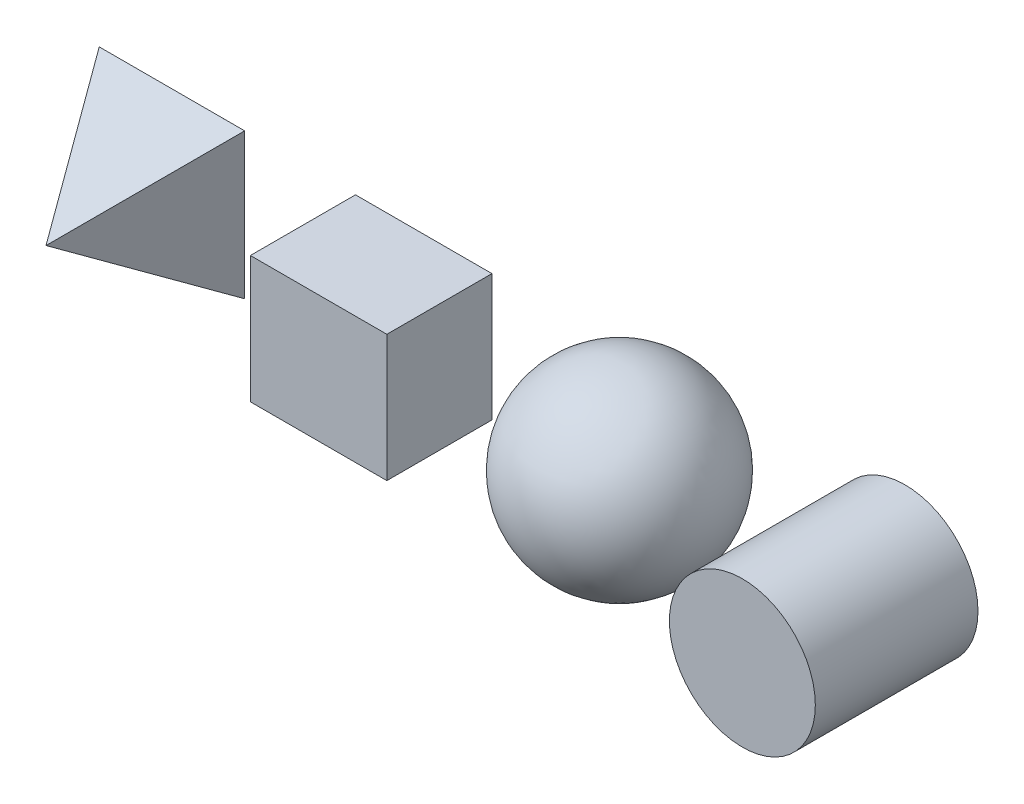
ISO-10303-21;
HEADER;
FILE_DESCRIPTION(('STEP AP214'),'2;1');
FILE_NAME('part.step','',(''),(''),'','','');
FILE_SCHEMA(('AUTOMOTIVE_DESIGN { 1 0 10303 214 1 1 1 1 }'));
ENDSEC;
DATA;
#1=APPLICATION_CONTEXT('core data for automotive mechanical design processes');
#2=APPLICATION_PROTOCOL_DEFINITION('international standard','automotive_design',2000,#1);
#3=PRODUCT_CONTEXT('',#1,'mechanical');
#4=PRODUCT('Part','Part','',(#3));
#5=PRODUCT_RELATED_PRODUCT_CATEGORY('part','',(#4));
#6=PRODUCT_DEFINITION_FORMATION('','',#4);
#7=PRODUCT_DEFINITION_CONTEXT('part definition',#1,'design');
#8=PRODUCT_DEFINITION('design','',#6,#7);
#9=PRODUCT_DEFINITION_SHAPE('','',#8);
#10=(LENGTH_UNIT() NAMED_UNIT(*) SI_UNIT(.MILLI.,.METRE.));
#11=(NAMED_UNIT(*) PLANE_ANGLE_UNIT() SI_UNIT($,.RADIAN.));
#12=(NAMED_UNIT(*) SI_UNIT($,.STERADIAN.) SOLID_ANGLE_UNIT());
#13=UNCERTAINTY_MEASURE_WITH_UNIT(LENGTH_MEASURE(1.E-05),#10,'distance_accuracy_value','');
#14=(GEOMETRIC_REPRESENTATION_CONTEXT(3) GLOBAL_UNCERTAINTY_ASSIGNED_CONTEXT((#13)) GLOBAL_UNIT_ASSIGNED_CONTEXT((#10,
#11,#12)) REPRESENTATION_CONTEXT('',''));
#15=CARTESIAN_POINT('',(0.,0.,0.));
#16=DIRECTION('',(0.,0.,1.));
#17=DIRECTION('',(1.,0.,0.));
#18=AXIS2_PLACEMENT_3D('',#15,#16,#17);
#19=CARTESIAN_POINT('',(56.326124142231,-9.08128608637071,9.75748641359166));
#20=DIRECTION('',(0.,1.,0.));
#21=DIRECTION('',(1.,0.,0.));
#22=AXIS2_PLACEMENT_3D('',#19,#20,#21);
#23=SPHERICAL_SURFACE('',#22,16.6165677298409);
#24=CARTESIAN_POINT('',(56.326124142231,7.53528164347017,9.75748641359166));
#25=VERTEX_POINT('',#24);
#26=VERTEX_LOOP('',#25);
#27=FACE_BOUND('',#26,.T.);
#28=ADVANCED_FACE('F39',(#27),#23,.T.);
#29=CLOSED_SHELL('',(#28));
#30=MANIFOLD_SOLID_BREP('B2',#29);
#31=CARTESIAN_POINT('',(96.9569140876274,-8.69775533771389,28.702));
#32=DIRECTION('',(0.,0.,-1.));
#33=DIRECTION('',(-1.,0.,0.));
#34=AXIS2_PLACEMENT_3D('',#31,#32,#33);
#35=CYLINDRICAL_SURFACE('',#34,12.874709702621);
#36=CARTESIAN_POINT('',(96.9569140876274,-8.69775533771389,28.702));
#37=DIRECTION('',(0.,0.,1.));
#38=DIRECTION('',(1.,0.,0.));
#39=AXIS2_PLACEMENT_3D('',#36,#37,#38);
#40=CIRCLE('',#39,12.874709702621);
#41=CARTESIAN_POINT('',(109.831623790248,-8.69775533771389,28.702));
#42=VERTEX_POINT('',#41);
#43=EDGE_CURVE('E38',#42,#42,#40,.T.);
#44=ORIENTED_EDGE('',*,*,#43,.F.);
#45=EDGE_LOOP('',(#44));
#46=FACE_BOUND('',#45,.T.);
#47=CARTESIAN_POINT('',(96.9569140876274,-8.69775533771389,0.));
#48=DIRECTION('',(0.,0.,1.));
#49=DIRECTION('',(1.,0.,0.));
#50=AXIS2_PLACEMENT_3D('',#47,#48,#49);
#51=CIRCLE('',#50,12.874709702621);
#52=CARTESIAN_POINT('',(109.831623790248,-8.69775533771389,0.));
#53=VERTEX_POINT('',#52);
#54=EDGE_CURVE('E64',#53,#53,#51,.T.);
#55=ORIENTED_EDGE('',*,*,#54,.T.);
#56=EDGE_LOOP('',(#55));
#57=FACE_BOUND('',#56,.T.);
#58=ADVANCED_FACE('F61',(#46,#57),#35,.T.);
#59=CARTESIAN_POINT('',(96.9569140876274,-8.69775533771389,28.702));
#60=DIRECTION('',(0.,0.,1.));
#61=DIRECTION('',(1.,0.,0.));
#62=AXIS2_PLACEMENT_3D('',#59,#60,#61);
#63=PLANE('',#62);
#64=ORIENTED_EDGE('',*,*,#43,.T.);
#65=EDGE_LOOP('',(#64));
#66=FACE_BOUND('',#65,.T.);
#67=ADVANCED_FACE('F76',(#66),#63,.T.);
#68=CARTESIAN_POINT('',(96.9569140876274,-8.69775533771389,0.));
#69=DIRECTION('',(0.,0.,1.));
#70=DIRECTION('',(1.,0.,0.));
#71=AXIS2_PLACEMENT_3D('',#68,#69,#70);
#72=PLANE('',#71);
#73=ORIENTED_EDGE('',*,*,#54,.F.);
#74=EDGE_LOOP('',(#73));
#75=FACE_BOUND('',#74,.T.);
#76=ADVANCED_FACE('F74',(#75),#72,.F.);
#77=CLOSED_SHELL('',(#58,#67,#76));
#78=MANIFOLD_SOLID_BREP('B6',#77);
#79=CARTESIAN_POINT('',(-19.5516794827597,0.,0.));
#80=DIRECTION('',(0.866025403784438,0.,0.500000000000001));
#81=DIRECTION('',(0.500000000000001,0.,-0.866025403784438));
#82=AXIS2_PLACEMENT_3D('',#79,#80,#81);
#83=PLANE('',#82);
#84=DIRECTION('',(0.,1.,0.));
#85=VECTOR('',#84,1.);
#86=CARTESIAN_POINT('',(-19.5516794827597,0.,0.));
#87=LINE('',#86,#85);
#88=CARTESIAN_POINT('',(-19.5516794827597,-25.6603593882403,0.));
#89=VERTEX_POINT('',#88);
#90=CARTESIAN_POINT('',(-19.5516794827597,0.,0.));
#91=VERTEX_POINT('',#90);
#92=EDGE_CURVE('E147',#89,#91,#87,.T.);
#93=ORIENTED_EDGE('',*,*,#92,.T.);
#94=DIRECTION('',(0.447213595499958,0.447213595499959,-0.774596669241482));
#95=VECTOR('',#94,1.);
#96=CARTESIAN_POINT('',(-19.5516794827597,0.,0.));
#97=LINE('',#96,#95);
#98=CARTESIAN_POINT('',(-32.3818591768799,-12.8301796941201,22.2225231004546));
#99=VERTEX_POINT('',#98);
#100=EDGE_CURVE('E59',#99,#91,#97,.T.);
#101=ORIENTED_EDGE('',*,*,#100,.F.);
#102=DIRECTION('',(0.447213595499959,-0.447213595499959,-0.774596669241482));
#103=VECTOR('',#102,1.);
#104=CARTESIAN_POINT('',(-24.6837513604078,-20.5282875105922,8.88900924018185));
#105=LINE('',#104,#103);
#106=EDGE_CURVE('E132',#99,#89,#105,.T.);
#107=ORIENTED_EDGE('',*,*,#106,.T.);
#108=EDGE_LOOP('',(#93,#101,#107));
#109=FACE_BOUND('',#108,.T.);
#110=ADVANCED_FACE('F110',(#109),#83,.T.);
#111=CARTESIAN_POINT('',(-19.5516794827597,0.,0.));
#112=DIRECTION('',(0.,0.866025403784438,0.500000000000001));
#113=DIRECTION('',(0.,-0.500000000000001,0.866025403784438));
#114=AXIS2_PLACEMENT_3D('',#111,#112,#113);
#115=PLANE('',#114);
#116=DIRECTION('',(-1.,0.,0.));
#117=VECTOR('',#116,1.);
#118=CARTESIAN_POINT('',(-19.5516794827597,0.,0.));
#119=LINE('',#118,#117);
#120=CARTESIAN_POINT('',(-45.212038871,0.,0.));
#121=VERTEX_POINT('',#120);
#122=EDGE_CURVE('E144',#91,#121,#119,.T.);
#123=ORIENTED_EDGE('',*,*,#122,.T.);
#124=DIRECTION('',(-0.447213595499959,0.447213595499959,-0.774596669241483));
#125=VECTOR('',#124,1.);
#126=CARTESIAN_POINT('',(-45.212038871,0.,0.));
#127=LINE('',#126,#125);
#128=EDGE_CURVE('E114',#99,#121,#127,.T.);
#129=ORIENTED_EDGE('',*,*,#128,.F.);
#130=ORIENTED_EDGE('',*,*,#100,.T.);
#131=EDGE_LOOP('',(#123,#129,#130));
#132=FACE_BOUND('',#131,.T.);
#133=ADVANCED_FACE('F112',(#132),#115,.T.);
#134=CARTESIAN_POINT('',(-45.212038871,0.,0.));
#135=DIRECTION('',(-0.866025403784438,0.,0.500000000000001));
#136=DIRECTION('',(0.500000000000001,0.,0.866025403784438));
#137=AXIS2_PLACEMENT_3D('',#134,#135,#136);
#138=PLANE('',#137);
#139=DIRECTION('',(0.,-1.,0.));
#140=VECTOR('',#139,1.);
#141=CARTESIAN_POINT('',(-45.212038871,0.,0.));
#142=LINE('',#141,#140);
#143=CARTESIAN_POINT('',(-45.212038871,-25.6603593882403,0.));
#144=VERTEX_POINT('',#143);
#145=EDGE_CURVE('E149',#121,#144,#142,.T.);
#146=ORIENTED_EDGE('',*,*,#145,.T.);
#147=DIRECTION('',(-0.447213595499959,-0.447213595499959,-0.774596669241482));
#148=VECTOR('',#147,1.);
#149=CARTESIAN_POINT('',(-40.0799669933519,-20.5282875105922,8.88900924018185));
#150=LINE('',#149,#148);
#151=EDGE_CURVE('E156',#99,#144,#150,.T.);
#152=ORIENTED_EDGE('',*,*,#151,.F.);
#153=ORIENTED_EDGE('',*,*,#128,.T.);
#154=EDGE_LOOP('',(#146,#152,#153));
#155=FACE_BOUND('',#154,.T.);
#156=ADVANCED_FACE('F159',(#155),#138,.T.);
#157=CARTESIAN_POINT('',(-19.5516794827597,-25.6603593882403,0.));
#158=DIRECTION('',(0.,-0.866025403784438,0.500000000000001));
#159=DIRECTION('',(0.,-0.500000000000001,-0.866025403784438));
#160=AXIS2_PLACEMENT_3D('',#157,#158,#159);
#161=PLANE('',#160);
#162=DIRECTION('',(1.,0.,0.));
#163=VECTOR('',#162,1.);
#164=CARTESIAN_POINT('',(-19.5516794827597,-25.6603593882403,0.));
#165=LINE('',#164,#163);
#166=EDGE_CURVE('E154',#144,#89,#165,.T.);
#167=ORIENTED_EDGE('',*,*,#166,.T.);
#168=ORIENTED_EDGE('',*,*,#106,.F.);
#169=ORIENTED_EDGE('',*,*,#151,.T.);
#170=EDGE_LOOP('',(#167,#168,#169));
#171=FACE_BOUND('',#170,.T.);
#172=ADVANCED_FACE('F160',(#171),#161,.T.);
#173=CARTESIAN_POINT('',(-19.5516794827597,0.,0.));
#174=DIRECTION('',(0.,0.,-1.));
#175=DIRECTION('',(-1.,0.,0.));
#176=AXIS2_PLACEMENT_3D('',#173,#174,#175);
#177=PLANE('',#176);
#178=ORIENTED_EDGE('',*,*,#92,.F.);
#179=ORIENTED_EDGE('',*,*,#166,.F.);
#180=ORIENTED_EDGE('',*,*,#145,.F.);
#181=ORIENTED_EDGE('',*,*,#122,.F.);
#182=EDGE_LOOP('',(#178,#179,#180,#181));
#183=FACE_BOUND('',#182,.T.);
#184=ADVANCED_FACE('F145',(#183),#177,.T.);
#185=CLOSED_SHELL('',(#110,#133,#156,#172,#184));
#186=MANIFOLD_SOLID_BREP('B33',#185);
#187=CARTESIAN_POINT('',(0.,0.,18.542));
#188=DIRECTION('',(1.,0.,0.));
#189=DIRECTION('',(0.,0.,-1.));
#190=AXIS2_PLACEMENT_3D('',#187,#188,#189);
#191=PLANE('',#190);
#192=DIRECTION('',(0.,-1.,0.));
#193=VECTOR('',#192,1.);
#194=CARTESIAN_POINT('',(0.,0.,0.));
#195=LINE('',#194,#193);
#196=CARTESIAN_POINT('',(0.,0.,0.));
#197=VERTEX_POINT('',#196);
#198=CARTESIAN_POINT('',(0.,-22.3640159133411,0.));
#199=VERTEX_POINT('',#198);
#200=EDGE_CURVE('E264',#197,#199,#195,.T.);
#201=ORIENTED_EDGE('',*,*,#200,.T.);
#202=DIRECTION('',(0.,0.,-1.));
#203=VECTOR('',#202,1.);
#204=CARTESIAN_POINT('',(0.,-22.3640159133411,18.542));
#205=LINE('',#204,#203);
#206=CARTESIAN_POINT('',(0.,-22.3640159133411,18.542));
#207=VERTEX_POINT('',#206);
#208=EDGE_CURVE('E108',#207,#199,#205,.T.);
#209=ORIENTED_EDGE('',*,*,#208,.F.);
#210=DIRECTION('',(0.,-1.,0.));
#211=VECTOR('',#210,1.);
#212=CARTESIAN_POINT('',(0.,0.,18.542));
#213=LINE('',#212,#211);
#214=CARTESIAN_POINT('',(0.,0.,18.542));
#215=VERTEX_POINT('',#214);
#216=EDGE_CURVE('E252',#215,#207,#213,.T.);
#217=ORIENTED_EDGE('',*,*,#216,.F.);
#218=DIRECTION('',(0.,0.,-1.));
#219=VECTOR('',#218,1.);
#220=CARTESIAN_POINT('',(0.,0.,18.542));
#221=LINE('',#220,#219);
#222=EDGE_CURVE('E260',#215,#197,#221,.T.);
#223=ORIENTED_EDGE('',*,*,#222,.T.);
#224=EDGE_LOOP('',(#201,#209,#217,#223));
#225=FACE_BOUND('',#224,.T.);
#226=ADVANCED_FACE('F201',(#225),#191,.F.);
#227=CARTESIAN_POINT('',(0.,-22.3640159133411,18.542));
#228=DIRECTION('',(0.,1.,0.));
#229=DIRECTION('',(0.,0.,1.));
#230=AXIS2_PLACEMENT_3D('',#227,#228,#229);
#231=PLANE('',#230);
#232=DIRECTION('',(1.,0.,0.));
#233=VECTOR('',#232,1.);
#234=CARTESIAN_POINT('',(0.,-22.3640159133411,0.));
#235=LINE('',#234,#233);
#236=CARTESIAN_POINT('',(24.0770824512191,-22.3640159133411,0.));
#237=VERTEX_POINT('',#236);
#238=EDGE_CURVE('E256',#199,#237,#235,.T.);
#239=ORIENTED_EDGE('',*,*,#238,.T.);
#240=DIRECTION('',(0.,0.,-1.));
#241=VECTOR('',#240,1.);
#242=CARTESIAN_POINT('',(24.0770824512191,-22.3640159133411,18.542));
#243=LINE('',#242,#241);
#244=CARTESIAN_POINT('',(24.0770824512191,-22.3640159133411,18.542));
#245=VERTEX_POINT('',#244);
#246=EDGE_CURVE('E209',#245,#237,#243,.T.);
#247=ORIENTED_EDGE('',*,*,#246,.F.);
#248=DIRECTION('',(1.,0.,0.));
#249=VECTOR('',#248,1.);
#250=CARTESIAN_POINT('',(0.,-22.3640159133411,18.542));
#251=LINE('',#250,#249);
#252=EDGE_CURVE('E247',#207,#245,#251,.T.);
#253=ORIENTED_EDGE('',*,*,#252,.F.);
#254=ORIENTED_EDGE('',*,*,#208,.T.);
#255=EDGE_LOOP('',(#239,#247,#253,#254));
#256=FACE_BOUND('',#255,.T.);
#257=ADVANCED_FACE('F255',(#256),#231,.F.);
#258=CARTESIAN_POINT('',(24.0770824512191,0.,18.542));
#259=DIRECTION('',(-1.,0.,0.));
#260=DIRECTION('',(0.,0.,1.));
#261=AXIS2_PLACEMENT_3D('',#258,#259,#260);
#262=PLANE('',#261);
#263=DIRECTION('',(0.,1.,0.));
#264=VECTOR('',#263,1.);
#265=CARTESIAN_POINT('',(24.0770824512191,0.,0.));
#266=LINE('',#265,#264);
#267=CARTESIAN_POINT('',(24.0770824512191,0.,0.));
#268=VERTEX_POINT('',#267);
#269=EDGE_CURVE('E234',#237,#268,#266,.T.);
#270=ORIENTED_EDGE('',*,*,#269,.T.);
#271=DIRECTION('',(0.,0.,-1.));
#272=VECTOR('',#271,1.);
#273=CARTESIAN_POINT('',(24.0770824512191,0.,18.542));
#274=LINE('',#273,#272);
#275=CARTESIAN_POINT('',(24.0770824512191,0.,18.542));
#276=VERTEX_POINT('',#275);
#277=EDGE_CURVE('E257',#276,#268,#274,.T.);
#278=ORIENTED_EDGE('',*,*,#277,.F.);
#279=DIRECTION('',(0.,1.,0.));
#280=VECTOR('',#279,1.);
#281=CARTESIAN_POINT('',(24.0770824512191,0.,18.542));
#282=LINE('',#281,#280);
#283=EDGE_CURVE('E250',#245,#276,#282,.T.);
#284=ORIENTED_EDGE('',*,*,#283,.F.);
#285=ORIENTED_EDGE('',*,*,#246,.T.);
#286=EDGE_LOOP('',(#270,#278,#284,#285));
#287=FACE_BOUND('',#286,.T.);
#288=ADVANCED_FACE('F258',(#287),#262,.F.);
#289=CARTESIAN_POINT('',(0.,0.,18.542));
#290=DIRECTION('',(0.,-1.,0.));
#291=DIRECTION('',(0.,0.,-1.));
#292=AXIS2_PLACEMENT_3D('',#289,#290,#291);
#293=PLANE('',#292);
#294=DIRECTION('',(-1.,0.,0.));
#295=VECTOR('',#294,1.);
#296=CARTESIAN_POINT('',(0.,0.,0.));
#297=LINE('',#296,#295);
#298=EDGE_CURVE('E240',#268,#197,#297,.T.);
#299=ORIENTED_EDGE('',*,*,#298,.T.);
#300=ORIENTED_EDGE('',*,*,#222,.F.);
#301=DIRECTION('',(-1.,0.,0.));
#302=VECTOR('',#301,1.);
#303=CARTESIAN_POINT('',(0.,0.,18.542));
#304=LINE('',#303,#302);
#305=EDGE_CURVE('E217',#276,#215,#304,.T.);
#306=ORIENTED_EDGE('',*,*,#305,.F.);
#307=ORIENTED_EDGE('',*,*,#277,.T.);
#308=EDGE_LOOP('',(#299,#300,#306,#307));
#309=FACE_BOUND('',#308,.T.);
#310=ADVANCED_FACE('F271',(#309),#293,.F.);
#311=CARTESIAN_POINT('',(0.,-22.3640159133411,18.542));
#312=DIRECTION('',(0.,0.,1.));
#313=DIRECTION('',(1.,0.,0.));
#314=AXIS2_PLACEMENT_3D('',#311,#312,#313);
#315=PLANE('',#314);
#316=ORIENTED_EDGE('',*,*,#216,.T.);
#317=ORIENTED_EDGE('',*,*,#252,.T.);
#318=ORIENTED_EDGE('',*,*,#283,.T.);
#319=ORIENTED_EDGE('',*,*,#305,.T.);
#320=EDGE_LOOP('',(#316,#317,#318,#319));
#321=FACE_BOUND('',#320,.T.);
#322=ADVANCED_FACE('F248',(#321),#315,.T.);
#323=CARTESIAN_POINT('',(0.,-22.3640159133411,0.));
#324=DIRECTION('',(0.,0.,1.));
#325=DIRECTION('',(1.,0.,0.));
#326=AXIS2_PLACEMENT_3D('',#323,#324,#325);
#327=PLANE('',#326);
#328=ORIENTED_EDGE('',*,*,#200,.F.);
#329=ORIENTED_EDGE('',*,*,#298,.F.);
#330=ORIENTED_EDGE('',*,*,#269,.F.);
#331=ORIENTED_EDGE('',*,*,#238,.F.);
#332=EDGE_LOOP('',(#328,#329,#330,#331));
#333=FACE_BOUND('',#332,.T.);
#334=ADVANCED_FACE('F274',(#333),#327,.F.);
#335=CLOSED_SHELL('',(#226,#257,#288,#310,#322,#334));
#336=MANIFOLD_SOLID_BREP('B53',#335);
#337=ADVANCED_BREP_SHAPE_REPRESENTATION('',(#18,#30,#78,#186,#336),#14);
#338=SHAPE_DEFINITION_REPRESENTATION(#9,#337);
ENDSEC;
END-ISO-10303-21;
